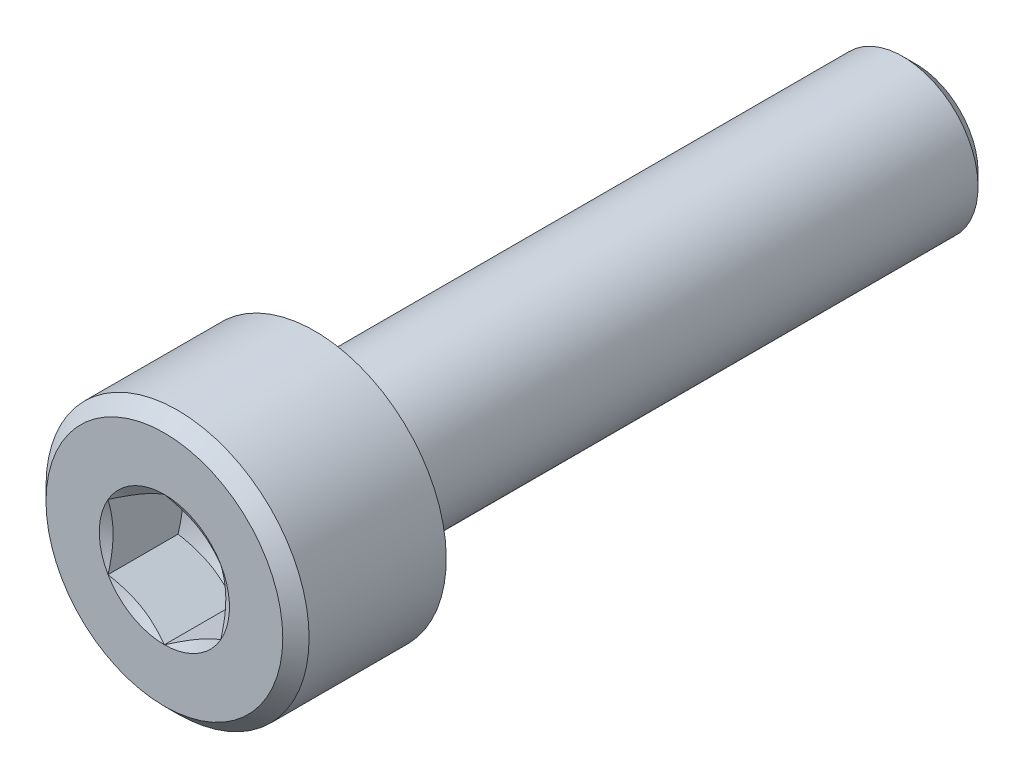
ISO-10303-21;
HEADER;
FILE_DESCRIPTION(('STEP AP214'),'2;1');
FILE_NAME('part.step','',(''),(''),'','','');
FILE_SCHEMA(('AUTOMOTIVE_DESIGN { 1 0 10303 214 1 1 1 1 }'));
ENDSEC;
DATA;
#1=APPLICATION_CONTEXT('core data for automotive mechanical design processes');
#2=APPLICATION_PROTOCOL_DEFINITION('international standard','automotive_design',2000,#1);
#3=PRODUCT_CONTEXT('',#1,'mechanical');
#4=PRODUCT('Part','Part','',(#3));
#5=PRODUCT_RELATED_PRODUCT_CATEGORY('part','',(#4));
#6=PRODUCT_DEFINITION_FORMATION('','',#4);
#7=PRODUCT_DEFINITION_CONTEXT('part definition',#1,'design');
#8=PRODUCT_DEFINITION('design','',#6,#7);
#9=PRODUCT_DEFINITION_SHAPE('','',#8);
#10=(LENGTH_UNIT() NAMED_UNIT(*) SI_UNIT(.MILLI.,.METRE.));
#11=(NAMED_UNIT(*) PLANE_ANGLE_UNIT() SI_UNIT($,.RADIAN.));
#12=(NAMED_UNIT(*) SI_UNIT($,.STERADIAN.) SOLID_ANGLE_UNIT());
#13=UNCERTAINTY_MEASURE_WITH_UNIT(LENGTH_MEASURE(1.E-05),#10,'distance_accuracy_value','');
#14=(GEOMETRIC_REPRESENTATION_CONTEXT(3) GLOBAL_UNCERTAINTY_ASSIGNED_CONTEXT((#13)) GLOBAL_UNIT_ASSIGNED_CONTEXT((#10,
#11,#12)) REPRESENTATION_CONTEXT('',''));
#15=CARTESIAN_POINT('',(0.,0.,0.));
#16=DIRECTION('',(0.,0.,1.));
#17=DIRECTION('',(1.,0.,0.));
#18=AXIS2_PLACEMENT_3D('',#15,#16,#17);
#19=CARTESIAN_POINT('',(0.,3.5,4.));
#20=DIRECTION('',(0.,0.,-1.));
#21=DIRECTION('',(0.,1.,0.));
#22=AXIS2_PLACEMENT_3D('',#19,#20,#21);
#23=PLANE('',#22);
#24=CARTESIAN_POINT('',(0.,0.,4.));
#25=DIRECTION('',(0.,0.,-1.));
#26=DIRECTION('',(0.,1.,0.));
#27=AXIS2_PLACEMENT_3D('',#24,#25,#26);
#28=CIRCLE('',#27,3.15);
#29=CARTESIAN_POINT('',(0.,3.15,4.));
#30=VERTEX_POINT('',#29);
#31=EDGE_CURVE('E297',#30,#30,#28,.F.);
#32=ORIENTED_EDGE('',*,*,#31,.T.);
#33=EDGE_LOOP('',(#32));
#34=FACE_BOUND('',#33,.T.);
#35=CARTESIAN_POINT('',(0.,0.,4.));
#36=DIRECTION('',(0.,0.,-1.));
#37=DIRECTION('',(0.,1.,0.));
#38=AXIS2_PLACEMENT_3D('',#35,#36,#37);
#39=CIRCLE('',#38,1.73205080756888);
#40=CARTESIAN_POINT('',(0.,1.73205080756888,4.));
#41=VERTEX_POINT('',#40);
#42=CARTESIAN_POINT('',(-1.5,0.866025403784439,4.));
#43=VERTEX_POINT('',#42);
#44=EDGE_CURVE('E106',#41,#43,#39,.F.);
#45=ORIENTED_EDGE('',*,*,#44,.F.);
#46=CARTESIAN_POINT('',(1.5,0.866025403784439,4.));
#47=VERTEX_POINT('',#46);
#48=EDGE_CURVE('E94',#47,#41,#39,.F.);
#49=ORIENTED_EDGE('',*,*,#48,.F.);
#50=CARTESIAN_POINT('',(1.5,-0.866025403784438,4.));
#51=VERTEX_POINT('',#50);
#52=EDGE_CURVE('E104',#51,#47,#39,.F.);
#53=ORIENTED_EDGE('',*,*,#52,.F.);
#54=CARTESIAN_POINT('',(0.,-1.73205080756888,4.));
#55=VERTEX_POINT('',#54);
#56=EDGE_CURVE('E497',#55,#51,#39,.F.);
#57=ORIENTED_EDGE('',*,*,#56,.F.);
#58=CARTESIAN_POINT('',(-1.5,-0.866025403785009,3.99999999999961));
#59=VERTEX_POINT('',#58);
#60=EDGE_CURVE('E140',#59,#55,#39,.F.);
#61=ORIENTED_EDGE('',*,*,#60,.F.);
#62=EDGE_CURVE('E136',#43,#59,#39,.F.);
#63=ORIENTED_EDGE('',*,*,#62,.F.);
#64=EDGE_LOOP('',(#45,#49,#53,#57,#61,#63));
#65=FACE_BOUND('',#64,.T.);
#66=ADVANCED_FACE('F37',(#34,#65),#23,.F.);
#67=CARTESIAN_POINT('',(0.,2.,0.));
#68=DIRECTION('',(0.,0.,1.));
#69=DIRECTION('',(0.,-1.,0.));
#70=AXIS2_PLACEMENT_3D('',#67,#68,#69);
#71=PLANE('',#70);
#72=CARTESIAN_POINT('',(0.,0.,0.));
#73=DIRECTION('',(0.,0.,1.));
#74=DIRECTION('',(0.,-1.,0.));
#75=AXIS2_PLACEMENT_3D('',#72,#73,#74);
#76=CIRCLE('',#75,2.4);
#77=CARTESIAN_POINT('',(0.,-2.4,0.));
#78=VERTEX_POINT('',#77);
#79=EDGE_CURVE('E46',#78,#78,#76,.T.);
#80=ORIENTED_EDGE('',*,*,#79,.T.);
#81=EDGE_LOOP('',(#80));
#82=FACE_BOUND('',#81,.T.);
#83=CARTESIAN_POINT('',(0.,0.,0.));
#84=DIRECTION('',(0.,0.,1.));
#85=DIRECTION('',(0.,-1.,0.));
#86=AXIS2_PLACEMENT_3D('',#83,#84,#85);
#87=CIRCLE('',#86,3.5);
#88=CARTESIAN_POINT('',(0.,-3.5,0.));
#89=VERTEX_POINT('',#88);
#90=EDGE_CURVE('E464',#89,#89,#87,.T.);
#91=ORIENTED_EDGE('',*,*,#90,.F.);
#92=EDGE_LOOP('',(#91));
#93=FACE_BOUND('',#92,.T.);
#94=ADVANCED_FACE('F255',(#82,#93),#71,.F.);
#95=CARTESIAN_POINT('',(0.,0.,4.));
#96=DIRECTION('',(0.,0.,1.));
#97=DIRECTION('',(0.,-1.,0.));
#98=AXIS2_PLACEMENT_3D('',#95,#96,#97);
#99=CYLINDRICAL_SURFACE('',#98,2.);
#100=CARTESIAN_POINT('',(0.,0.,-0.4));
#101=DIRECTION('',(0.,0.,1.));
#102=DIRECTION('',(0.,-1.,0.));
#103=AXIS2_PLACEMENT_3D('',#100,#101,#102);
#104=CIRCLE('',#103,2.);
#105=CARTESIAN_POINT('',(0.,-2.,-0.4));
#106=VERTEX_POINT('',#105);
#107=EDGE_CURVE('E12',#106,#106,#104,.F.);
#108=ORIENTED_EDGE('',*,*,#107,.T.);
#109=EDGE_LOOP('',(#108));
#110=FACE_BOUND('',#109,.T.);
#111=CARTESIAN_POINT('',(0.,0.,-15.65));
#112=DIRECTION('',(0.,0.,1.));
#113=DIRECTION('',(0.,-1.,0.));
#114=AXIS2_PLACEMENT_3D('',#111,#112,#113);
#115=CIRCLE('',#114,2.);
#116=CARTESIAN_POINT('',(0.,-2.,-15.65));
#117=VERTEX_POINT('',#116);
#118=EDGE_CURVE('E287',#117,#117,#115,.T.);
#119=ORIENTED_EDGE('',*,*,#118,.T.);
#120=EDGE_LOOP('',(#119));
#121=FACE_BOUND('',#120,.T.);
#122=ADVANCED_FACE('F260',(#110,#121),#99,.T.);
#123=CARTESIAN_POINT('',(0.,0.,-16.));
#124=DIRECTION('',(0.,0.,1.));
#125=DIRECTION('',(0.,-1.,0.));
#126=AXIS2_PLACEMENT_3D('',#123,#124,#125);
#127=PLANE('',#126);
#128=CARTESIAN_POINT('',(0.,0.,-16.));
#129=DIRECTION('',(0.,0.,1.));
#130=DIRECTION('',(0.,-1.,0.));
#131=AXIS2_PLACEMENT_3D('',#128,#129,#130);
#132=CIRCLE('',#131,1.64999999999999);
#133=CARTESIAN_POINT('',(0.,-1.64999999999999,-16.));
#134=VERTEX_POINT('',#133);
#135=EDGE_CURVE('E117',#134,#134,#132,.F.);
#136=ORIENTED_EDGE('',*,*,#135,.T.);
#137=EDGE_LOOP('',(#136));
#138=FACE_BOUND('',#137,.T.);
#139=ADVANCED_FACE('F265',(#138),#127,.F.);
#140=CARTESIAN_POINT('',(0.,0.,4.));
#141=DIRECTION('',(0.,0.,1.));
#142=DIRECTION('',(0.,-1.,0.));
#143=AXIS2_PLACEMENT_3D('',#140,#141,#142);
#144=CYLINDRICAL_SURFACE('',#143,3.5);
#145=CARTESIAN_POINT('',(0.,0.,3.65));
#146=DIRECTION('',(0.,0.,-1.));
#147=DIRECTION('',(0.,1.,0.));
#148=AXIS2_PLACEMENT_3D('',#145,#146,#147);
#149=CIRCLE('',#148,3.5);
#150=CARTESIAN_POINT('',(0.,3.5,3.65));
#151=VERTEX_POINT('',#150);
#152=EDGE_CURVE('E290',#151,#151,#149,.T.);
#153=ORIENTED_EDGE('',*,*,#152,.T.);
#154=EDGE_LOOP('',(#153));
#155=FACE_BOUND('',#154,.T.);
#156=ORIENTED_EDGE('',*,*,#90,.T.);
#157=EDGE_LOOP('',(#156));
#158=FACE_BOUND('',#157,.T.);
#159=ADVANCED_FACE('F175',(#155,#158),#144,.T.);
#160=CARTESIAN_POINT('',(0.,0.,4.));
#161=DIRECTION('',(0.,0.,-1.));
#162=DIRECTION('',(0.,1.,0.));
#163=AXIS2_PLACEMENT_3D('',#160,#161,#162);
#164=CONICAL_SURFACE('',#163,3.15,0.785398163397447);
#165=ORIENTED_EDGE('',*,*,#152,.F.);
#166=EDGE_LOOP('',(#165));
#167=FACE_BOUND('',#166,.T.);
#168=ORIENTED_EDGE('',*,*,#31,.F.);
#169=EDGE_LOOP('',(#168));
#170=FACE_BOUND('',#169,.T.);
#171=ADVANCED_FACE('F272',(#167,#170),#164,.T.);
#172=CARTESIAN_POINT('',(0.,0.,-15.65));
#173=DIRECTION('',(0.,0.,1.));
#174=DIRECTION('',(0.,-1.,0.));
#175=AXIS2_PLACEMENT_3D('',#172,#173,#174);
#176=CONICAL_SURFACE('',#175,2.,0.78539816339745);
#177=ORIENTED_EDGE('',*,*,#135,.F.);
#178=EDGE_LOOP('',(#177));
#179=FACE_BOUND('',#178,.T.);
#180=ORIENTED_EDGE('',*,*,#118,.F.);
#181=EDGE_LOOP('',(#180));
#182=FACE_BOUND('',#181,.T.);
#183=ADVANCED_FACE('F274',(#179,#182),#176,.T.);
#184=CARTESIAN_POINT('',(0.,0.,3.86602540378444));
#185=DIRECTION('',(0.,0.,1.));
#186=DIRECTION('',(0.,-1.,0.));
#187=AXIS2_PLACEMENT_3D('',#184,#185,#186);
#188=CONICAL_SURFACE('',#187,1.5,1.04719755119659);
#189=ORIENTED_EDGE('',*,*,#44,.T.);
#190=CARTESIAN_POINT('',(-1.5002,0.865909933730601,4.00006667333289));
#191=CARTESIAN_POINT('',(-1.43428070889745,0.903968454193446,3.97808285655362));
#192=CARTESIAN_POINT('',(-1.36779241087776,0.942355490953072,3.95808888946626));
#193=CARTESIAN_POINT('',(-1.23366433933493,1.01979436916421,3.92318810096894));
#194=CARTESIAN_POINT('',(-1.16602218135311,1.05884758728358,3.9082936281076));
#195=CARTESIAN_POINT('',(-1.03157622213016,1.13646999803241,3.88510668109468));
#196=CARTESIAN_POINT('',(-0.96479311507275,1.17502724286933,3.87665991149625));
#197=CARTESIAN_POINT('',(-0.830912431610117,1.25232329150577,3.86657357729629));
#198=CARTESIAN_POINT('',(-0.763815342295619,1.29106181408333,3.86492566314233));
#199=CARTESIAN_POINT('',(-0.638425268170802,1.363455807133,3.86834162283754));
#200=CARTESIAN_POINT('',(-0.580113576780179,1.39712207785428,3.87256675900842));
#201=CARTESIAN_POINT('',(-0.463870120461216,1.46423526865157,3.88596177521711));
#202=CARTESIAN_POINT('',(-0.405938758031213,1.49768195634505,3.89513623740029));
#203=CARTESIAN_POINT('',(-0.289455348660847,1.56493368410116,3.91807318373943));
#204=CARTESIAN_POINT('',(-0.230918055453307,1.59873020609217,3.93193296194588));
#205=CARTESIAN_POINT('',(-0.11471687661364,1.6658189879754,3.96338978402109));
#206=CARTESIAN_POINT('',(-0.0570515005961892,1.699112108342,3.98097942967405));
#207=CARTESIAN_POINT('',(0.000199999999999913,1.73216627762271,4.00006667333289));
#208=B_SPLINE_CURVE_WITH_KNOTS('',3,(#190,#191,#192,#193,#194,#195,#196,#197,#198,#199,#200,
#201,#202,#203,#204,#205,#206,#207),.UNSPECIFIED.,.F.,.F.,(4,2,2,2,2,2,2,2,4),(0.,
0.237777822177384,0.47612742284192,0.708577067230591,0.940741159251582,1.14294352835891,
1.34533342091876,1.55221450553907,1.75868901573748),.UNSPECIFIED.);
#209=EDGE_CURVE('E110',#43,#41,#208,.T.);
#210=ORIENTED_EDGE('',*,*,#209,.T.);
#211=EDGE_LOOP('',(#189,#210));
#212=FACE_BOUND('',#211,.T.);
#213=ADVANCED_FACE('F111',(#212),#188,.F.);
#214=ORIENTED_EDGE('',*,*,#62,.T.);
#215=CARTESIAN_POINT('',(-1.5,-2.29682699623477,4.58381546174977));
#216=CARTESIAN_POINT('',(-1.5,-2.2309684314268,4.55198894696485));
#217=CARTESIAN_POINT('',(-1.5,-2.16495427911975,4.52047890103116));
#218=CARTESIAN_POINT('',(-1.5,-2.03253035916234,4.45827236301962));
#219=CARTESIAN_POINT('',(-1.5,-1.96612052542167,4.42757601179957));
#220=CARTESIAN_POINT('',(-1.5,-1.83246206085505,4.36701576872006));
#221=CARTESIAN_POINT('',(-1.5,-1.76521080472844,4.33715764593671));
#222=CARTESIAN_POINT('',(-1.5,-1.63015654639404,4.27872457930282));
#223=CARTESIAN_POINT('',(-1.5,-1.56235357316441,4.25014956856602));
#224=CARTESIAN_POINT('',(-1.5,-1.42524182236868,4.19428123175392));
#225=CARTESIAN_POINT('',(-1.5,-1.35592477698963,4.1670079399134));
#226=CARTESIAN_POINT('',(-1.5,-1.21648682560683,4.114607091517));
#227=CARTESIAN_POINT('',(-1.5,-1.14636582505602,4.08947979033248));
#228=CARTESIAN_POINT('',(-1.5,-0.934888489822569,4.01830655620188));
#229=CARTESIAN_POINT('',(-1.5,-0.792055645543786,3.97631519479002));
#230=CARTESIAN_POINT('',(-1.5,-0.574716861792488,3.92662686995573));
#231=CARTESIAN_POINT('',(-1.5,-0.501740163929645,3.91227894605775));
#232=CARTESIAN_POINT('',(-1.5,-0.35490257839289,3.88900178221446));
#233=CARTESIAN_POINT('',(-1.5,-0.281041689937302,3.88007254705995));
#234=CARTESIAN_POINT('',(-1.5,-0.133293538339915,3.86841949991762));
#235=CARTESIAN_POINT('',(-1.5,-0.0594094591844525,3.86565640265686));
#236=CARTESIAN_POINT('',(-1.5,0.0882997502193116,3.86647471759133));
#237=CARTESIAN_POINT('',(-1.5,0.16212489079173,3.87005448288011));
#238=CARTESIAN_POINT('',(-1.5,0.340722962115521,3.88606868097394));
#239=CARTESIAN_POINT('',(-1.5,0.445215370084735,3.9016376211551));
#240=CARTESIAN_POINT('',(-1.5,0.652266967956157,3.94267501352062));
#241=CARTESIAN_POINT('',(-1.5,0.75482373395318,3.96815511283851));
#242=CARTESIAN_POINT('',(-1.5,0.908315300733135,4.0120946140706));
#243=CARTESIAN_POINT('',(-1.5,0.960034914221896,4.02791828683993));
#244=CARTESIAN_POINT('',(-1.5,1.06293144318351,4.0611319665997));
#245=CARTESIAN_POINT('',(-1.5,1.11410870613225,4.07852089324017));
#246=CARTESIAN_POINT('',(-1.5,1.21571016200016,4.11450258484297));
#247=CARTESIAN_POINT('',(-1.5,1.26613697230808,4.13308802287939));
#248=CARTESIAN_POINT('',(-1.5,1.36659934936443,4.17134976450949));
#249=CARTESIAN_POINT('',(-1.5,1.41663474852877,4.19102650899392));
#250=CARTESIAN_POINT('',(-1.5,1.46648887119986,4.21114128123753));
#251=B_SPLINE_CURVE_WITH_KNOTS('',3,(#215,#216,#217,#218,#219,#220,#221,#222,#223,#224,#225,
#226,#227,#228,#229,#230,#231,#232,#233,#234,#235,#236,#237,#238,#239,#240,#241,#242,#243,#244,
#245,#246,#247,#248,#249,#250),.UNSPECIFIED.,.F.,.F.,(4,2,2,2,2,2,2,2,2,2,2,2,2,2,2,2,2,4),(0.,
0.219439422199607,0.438916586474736,0.659649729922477,0.880371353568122,1.10380188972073,
1.32725897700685,1.77299403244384,1.99595442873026,2.21891502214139,2.44045099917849,
2.66192946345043,2.97821851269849,3.29488037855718,3.45711959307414,3.6192476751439,
3.78046319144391,3.94174432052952),.UNSPECIFIED.);
#252=EDGE_CURVE('E237',#59,#43,#251,.T.);
#253=ORIENTED_EDGE('',*,*,#252,.T.);
#254=EDGE_LOOP('',(#214,#253));
#255=FACE_BOUND('',#254,.T.);
#256=ADVANCED_FACE('F281',(#255),#188,.F.);
#257=ORIENTED_EDGE('',*,*,#60,.T.);
#258=CARTESIAN_POINT('',(0.000200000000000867,-1.73216627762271,4.00006667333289));
#259=CARTESIAN_POINT('',(-0.0657192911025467,-1.69410775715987,3.97808285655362));
#260=CARTESIAN_POINT('',(-0.132207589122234,-1.65572072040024,3.95808888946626));
#261=CARTESIAN_POINT('',(-0.266335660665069,-1.5782818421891,3.92318810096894));
#262=CARTESIAN_POINT('',(-0.333977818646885,-1.53922862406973,3.9082936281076));
#263=CARTESIAN_POINT('',(-0.468423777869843,-1.4616062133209,3.88510668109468));
#264=CARTESIAN_POINT('',(-0.535206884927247,-1.42304896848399,3.87665991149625));
#265=CARTESIAN_POINT('',(-0.66908756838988,-1.34575291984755,3.86657357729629));
#266=CARTESIAN_POINT('',(-0.736184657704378,-1.30701439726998,3.86492566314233));
#267=CARTESIAN_POINT('',(-0.861574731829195,-1.23462040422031,3.86834162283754));
#268=CARTESIAN_POINT('',(-0.919886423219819,-1.20095413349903,3.87256675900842));
#269=CARTESIAN_POINT('',(-1.03612987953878,-1.13384094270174,3.88596177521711));
#270=CARTESIAN_POINT('',(-1.09406124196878,-1.10039425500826,3.89513623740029));
#271=CARTESIAN_POINT('',(-1.21054465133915,-1.03314252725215,3.91807318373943));
#272=CARTESIAN_POINT('',(-1.26908194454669,-0.99934600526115,3.93193296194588));
#273=CARTESIAN_POINT('',(-1.38528312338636,-0.932257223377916,3.96338978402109));
#274=CARTESIAN_POINT('',(-1.44294849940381,-0.89896410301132,3.98097942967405));
#275=CARTESIAN_POINT('',(-1.5002,-0.8659099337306,4.00006667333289));
#276=B_SPLINE_CURVE_WITH_KNOTS('',3,(#258,#259,#260,#261,#262,#263,#264,#265,#266,#267,#268,
#269,#270,#271,#272,#273,#274,#275),.UNSPECIFIED.,.F.,.F.,(4,2,2,2,2,2,2,2,4),(0.,
0.237777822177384,0.47612742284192,0.708577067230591,0.940741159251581,1.14294352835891,
1.34533342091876,1.55221450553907,1.75868901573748),.UNSPECIFIED.);
#277=EDGE_CURVE('E230',#55,#59,#276,.T.);
#278=ORIENTED_EDGE('',*,*,#277,.T.);
#279=EDGE_LOOP('',(#257,#278));
#280=FACE_BOUND('',#279,.T.);
#281=ADVANCED_FACE('F383',(#280),#188,.F.);
#282=ORIENTED_EDGE('',*,*,#56,.T.);
#283=CARTESIAN_POINT('',(1.5002,-0.8659099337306,4.00006667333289));
#284=CARTESIAN_POINT('',(1.43428070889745,-0.903968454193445,3.97808285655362));
#285=CARTESIAN_POINT('',(1.36779241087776,-0.942355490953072,3.95808888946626));
#286=CARTESIAN_POINT('',(1.23366433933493,-1.01979436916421,3.92318810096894));
#287=CARTESIAN_POINT('',(1.16602218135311,-1.05884758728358,3.9082936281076));
#288=CARTESIAN_POINT('',(1.03157622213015,-1.13646999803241,3.88510668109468));
#289=CARTESIAN_POINT('',(0.96479311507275,-1.17502724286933,3.87665991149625));
#290=CARTESIAN_POINT('',(0.830912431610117,-1.25232329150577,3.86657357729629));
#291=CARTESIAN_POINT('',(0.763815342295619,-1.29106181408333,3.86492566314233));
#292=CARTESIAN_POINT('',(0.638425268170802,-1.363455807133,3.86834162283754));
#293=CARTESIAN_POINT('',(0.580113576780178,-1.39712207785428,3.87256675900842));
#294=CARTESIAN_POINT('',(0.463870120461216,-1.46423526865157,3.88596177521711));
#295=CARTESIAN_POINT('',(0.405938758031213,-1.49768195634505,3.89513623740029));
#296=CARTESIAN_POINT('',(0.289455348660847,-1.56493368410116,3.91807318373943));
#297=CARTESIAN_POINT('',(0.230918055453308,-1.59873020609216,3.93193296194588));
#298=CARTESIAN_POINT('',(0.11471687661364,-1.6658189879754,3.96338978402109));
#299=CARTESIAN_POINT('',(0.0570515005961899,-1.69911210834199,3.98097942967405));
#300=CARTESIAN_POINT('',(-0.000199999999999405,-1.73216627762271,4.00006667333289));
#301=B_SPLINE_CURVE_WITH_KNOTS('',3,(#283,#284,#285,#286,#287,#288,#289,#290,#291,#292,#293,
#294,#295,#296,#297,#298,#299,#300),.UNSPECIFIED.,.F.,.F.,(4,2,2,2,2,2,2,2,4),(0.,
0.237777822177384,0.476127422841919,0.70857706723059,0.940741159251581,1.1429435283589,
1.34533342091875,1.55221450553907,1.75868901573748),.UNSPECIFIED.);
#302=EDGE_CURVE('E58',#51,#55,#301,.T.);
#303=ORIENTED_EDGE('',*,*,#302,.T.);
#304=EDGE_LOOP('',(#282,#303));
#305=FACE_BOUND('',#304,.T.);
#306=ADVANCED_FACE('F392',(#305),#188,.F.);
#307=ORIENTED_EDGE('',*,*,#52,.T.);
#308=CARTESIAN_POINT('',(1.5,-2.29682699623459,4.58381546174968));
#309=CARTESIAN_POINT('',(1.5,-2.23096843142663,4.55198894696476));
#310=CARTESIAN_POINT('',(1.5,-2.16495427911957,4.52047890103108));
#311=CARTESIAN_POINT('',(1.5,-2.03253035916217,4.45827236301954));
#312=CARTESIAN_POINT('',(1.5,-1.9661205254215,4.42757601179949));
#313=CARTESIAN_POINT('',(1.5,-1.83246206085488,4.36701576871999));
#314=CARTESIAN_POINT('',(1.5,-1.76521080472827,4.33715764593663));
#315=CARTESIAN_POINT('',(1.5,-1.63015654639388,4.27872457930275));
#316=CARTESIAN_POINT('',(1.5,-1.56235357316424,4.25014956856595));
#317=CARTESIAN_POINT('',(1.5,-1.42524182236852,4.19428123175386));
#318=CARTESIAN_POINT('',(1.5,-1.35592477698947,4.16700793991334));
#319=CARTESIAN_POINT('',(1.5,-1.21648682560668,4.11460709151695));
#320=CARTESIAN_POINT('',(1.5,-1.14636582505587,4.08947979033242));
#321=CARTESIAN_POINT('',(1.5,-0.934888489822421,4.01830655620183));
#322=CARTESIAN_POINT('',(1.5,-0.792055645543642,3.97631519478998));
#323=CARTESIAN_POINT('',(1.5,-0.57471686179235,3.9266268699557));
#324=CARTESIAN_POINT('',(1.5,-0.501740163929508,3.91227894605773));
#325=CARTESIAN_POINT('',(1.5,-0.354902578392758,3.88900178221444));
#326=CARTESIAN_POINT('',(1.5,-0.281041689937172,3.88007254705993));
#327=CARTESIAN_POINT('',(1.5,-0.133293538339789,3.86841949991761));
#328=CARTESIAN_POINT('',(1.5,-0.0594094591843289,3.86565640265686));
#329=CARTESIAN_POINT('',(1.5,0.0882997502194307,3.86647471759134));
#330=CARTESIAN_POINT('',(1.5,0.162124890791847,3.87005448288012));
#331=CARTESIAN_POINT('',(1.5,0.340722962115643,3.88606868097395));
#332=CARTESIAN_POINT('',(1.5,0.445215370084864,3.90163762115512));
#333=CARTESIAN_POINT('',(1.5,0.6522669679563,3.94267501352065));
#334=CARTESIAN_POINT('',(1.5,0.75482373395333,3.96815511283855));
#335=CARTESIAN_POINT('',(1.5,0.908315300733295,4.01209461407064));
#336=CARTESIAN_POINT('',(1.5,0.96003491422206,4.02791828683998));
#337=CARTESIAN_POINT('',(1.5,1.06293144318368,4.06113196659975));
#338=CARTESIAN_POINT('',(1.5,1.11410870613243,4.07852089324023));
#339=CARTESIAN_POINT('',(1.5,1.21571016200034,4.11450258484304));
#340=CARTESIAN_POINT('',(1.5,1.26613697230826,4.13308802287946));
#341=CARTESIAN_POINT('',(1.5,1.36659934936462,4.17134976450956));
#342=CARTESIAN_POINT('',(1.5,1.41663474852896,4.19102650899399));
#343=CARTESIAN_POINT('',(1.5,1.46648887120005,4.21114128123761));
#344=B_SPLINE_CURVE_WITH_KNOTS('',3,(#308,#309,#310,#311,#312,#313,#314,#315,#316,#317,#318,
#319,#320,#321,#322,#323,#324,#325,#326,#327,#328,#329,#330,#331,#332,#333,#334,#335,#336,#337,
#338,#339,#340,#341,#342,#343),.UNSPECIFIED.,.F.,.F.,(4,2,2,2,2,2,2,2,2,2,2,2,2,2,2,2,2,4),(0.,
0.219439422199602,0.438916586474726,0.659649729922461,0.8803713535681,1.1038018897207,
1.32725897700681,1.77299403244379,1.99595442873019,2.21891502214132,2.44045099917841,
2.66192946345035,2.97821851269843,3.29488037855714,3.45711959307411,3.61924767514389,
3.78046319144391,3.94174432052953),.UNSPECIFIED.);
#345=EDGE_CURVE('E52',#47,#51,#344,.F.);
#346=ORIENTED_EDGE('',*,*,#345,.T.);
#347=EDGE_LOOP('',(#307,#346));
#348=FACE_BOUND('',#347,.T.);
#349=ADVANCED_FACE('F401',(#348),#188,.F.);
#350=ORIENTED_EDGE('',*,*,#48,.T.);
#351=CARTESIAN_POINT('',(-0.000200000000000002,1.73216627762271,4.00006667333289));
#352=CARTESIAN_POINT('',(0.0657192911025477,1.69410775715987,3.97808285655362));
#353=CARTESIAN_POINT('',(0.132207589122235,1.65572072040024,3.95808888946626));
#354=CARTESIAN_POINT('',(0.266335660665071,1.5782818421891,3.92318810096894));
#355=CARTESIAN_POINT('',(0.333977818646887,1.53922862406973,3.9082936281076));
#356=CARTESIAN_POINT('',(0.468423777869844,1.4616062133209,3.88510668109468));
#357=CARTESIAN_POINT('',(0.535206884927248,1.42304896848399,3.87665991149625));
#358=CARTESIAN_POINT('',(0.669087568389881,1.34575291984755,3.86657357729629));
#359=CARTESIAN_POINT('',(0.736184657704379,1.30701439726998,3.86492566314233));
#360=CARTESIAN_POINT('',(0.861574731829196,1.23462040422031,3.86834162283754));
#361=CARTESIAN_POINT('',(0.91988642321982,1.20095413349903,3.87256675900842));
#362=CARTESIAN_POINT('',(1.03612987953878,1.13384094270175,3.88596177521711));
#363=CARTESIAN_POINT('',(1.09406124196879,1.10039425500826,3.89513623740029));
#364=CARTESIAN_POINT('',(1.21054465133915,1.03314252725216,3.91807318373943));
#365=CARTESIAN_POINT('',(1.26908194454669,0.999346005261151,3.93193296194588));
#366=CARTESIAN_POINT('',(1.38528312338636,0.932257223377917,3.96338978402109));
#367=CARTESIAN_POINT('',(1.44294849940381,0.898964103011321,3.98097942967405));
#368=CARTESIAN_POINT('',(1.5002,0.865909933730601,4.00006667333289));
#369=B_SPLINE_CURVE_WITH_KNOTS('',3,(#351,#352,#353,#354,#355,#356,#357,#358,#359,#360,#361,
#362,#363,#364,#365,#366,#367,#368),.UNSPECIFIED.,.F.,.F.,(4,2,2,2,2,2,2,2,4),(0.,
0.237777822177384,0.47612742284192,0.708577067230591,0.940741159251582,1.14294352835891,
1.34533342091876,1.55221450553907,1.75868901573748),.UNSPECIFIED.);
#370=EDGE_CURVE('E98',#41,#47,#369,.T.);
#371=ORIENTED_EDGE('',*,*,#370,.T.);
#372=EDGE_LOOP('',(#350,#371));
#373=FACE_BOUND('',#372,.T.);
#374=ADVANCED_FACE('F96',(#373),#188,.F.);
#375=CARTESIAN_POINT('',(0.,0.,1.13397459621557));
#376=DIRECTION('',(0.,0.,1.));
#377=DIRECTION('',(1.,0.,0.));
#378=AXIS2_PLACEMENT_3D('',#375,#376,#377);
#379=CONICAL_SURFACE('',#378,0.,1.0471975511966);
#380=CARTESIAN_POINT('',(1.5002,-0.8659099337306,2.13404126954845));
#381=CARTESIAN_POINT('',(1.43428070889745,-0.903968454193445,2.11205745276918));
#382=CARTESIAN_POINT('',(1.36779241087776,-0.942355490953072,2.09206348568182));
#383=CARTESIAN_POINT('',(1.23366433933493,-1.01979436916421,2.05716269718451));
#384=CARTESIAN_POINT('',(1.16602218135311,-1.05884758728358,2.04226822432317));
#385=CARTESIAN_POINT('',(1.03157622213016,-1.13646999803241,2.01908127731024));
#386=CARTESIAN_POINT('',(0.964793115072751,-1.17502724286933,2.01063450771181));
#387=CARTESIAN_POINT('',(0.830912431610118,-1.25232329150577,2.00054817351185));
#388=CARTESIAN_POINT('',(0.76381534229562,-1.29106181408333,1.99890025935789));
#389=CARTESIAN_POINT('',(0.638425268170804,-1.363455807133,2.0023162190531));
#390=CARTESIAN_POINT('',(0.58011357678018,-1.39712207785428,2.00654135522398));
#391=CARTESIAN_POINT('',(0.463870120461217,-1.46423526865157,2.01993637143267));
#392=CARTESIAN_POINT('',(0.405938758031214,-1.49768195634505,2.02911083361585));
#393=CARTESIAN_POINT('',(0.289455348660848,-1.56493368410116,2.05204777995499));
#394=CARTESIAN_POINT('',(0.230918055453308,-1.59873020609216,2.06590755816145));
#395=CARTESIAN_POINT('',(0.114716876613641,-1.6658189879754,2.09736438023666));
#396=CARTESIAN_POINT('',(0.0570515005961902,-1.69911210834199,2.11495402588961));
#397=CARTESIAN_POINT('',(-0.000199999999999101,-1.73216627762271,2.13404126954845));
#398=B_SPLINE_CURVE_WITH_KNOTS('',3,(#380,#381,#382,#383,#384,#385,#386,#387,#388,#389,#390,
#391,#392,#393,#394,#395,#396,#397),.UNSPECIFIED.,.F.,.F.,(4,2,2,2,2,2,2,2,4),(0.,
0.237777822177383,0.476127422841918,0.708577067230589,0.940741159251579,1.1429435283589,
1.34533342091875,1.55221450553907,1.75868901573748),.UNSPECIFIED.);
#399=CARTESIAN_POINT('',(1.5,-0.866025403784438,2.13397459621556));
#400=VERTEX_POINT('',#399);
#401=CARTESIAN_POINT('',(0.,-1.73205080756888,2.13397459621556));
#402=VERTEX_POINT('',#401);
#403=EDGE_CURVE('E189',#400,#402,#398,.T.);
#404=ORIENTED_EDGE('',*,*,#403,.F.);
#405=CARTESIAN_POINT('',(1.5,-2.33638172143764,2.73695926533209));
#406=CARTESIAN_POINT('',(1.5,-2.27073746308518,2.7050753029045));
#407=CARTESIAN_POINT('',(1.5,-2.20494350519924,2.67349431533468));
#408=CARTESIAN_POINT('',(1.5,-2.07297652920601,2.61110864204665));
#409=CARTESIAN_POINT('',(1.5,-2.00680345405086,2.5803040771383));
#410=CARTESIAN_POINT('',(1.5,-1.87366303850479,2.51948904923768));
#411=CARTESIAN_POINT('',(1.5,-1.80669334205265,2.48948372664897));
#412=CARTESIAN_POINT('',(1.5,-1.67222431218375,2.43068893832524));
#413=CARTESIAN_POINT('',(1.5,-1.60472500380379,2.40189941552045));
#414=CARTESIAN_POINT('',(1.5,-1.46696329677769,2.34497876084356));
#415=CARTESIAN_POINT('',(1.5,-1.39668058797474,2.31689651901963));
#416=CARTESIAN_POINT('',(1.5,-1.25529643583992,2.26283280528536));
#417=CARTESIAN_POINT('',(1.5,-1.1841948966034,2.23685158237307));
#418=CARTESIAN_POINT('',(1.5,-1.04119289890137,2.18766516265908));
#419=CARTESIAN_POINT('',(1.5,-0.969294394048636,2.16445434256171));
#420=CARTESIAN_POINT('',(1.5,-0.824460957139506,2.12154326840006));
#421=CARTESIAN_POINT('',(1.5,-0.751526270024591,2.10184219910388));
#422=CARTESIAN_POINT('',(1.5,-0.604949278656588,2.06698624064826));
#423=CARTESIAN_POINT('',(1.5,-0.531312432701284,2.05180882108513));
#424=CARTESIAN_POINT('',(1.5,-0.383114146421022,2.0268654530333));
#425=CARTESIAN_POINT('',(1.5,-0.308552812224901,2.0170988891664));
#426=CARTESIAN_POINT('',(1.5,-0.159849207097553,2.00388569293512));
#427=CARTESIAN_POINT('',(1.5,-0.0857144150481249,2.00035726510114));
#428=CARTESIAN_POINT('',(1.5,0.0625848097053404,1.9996942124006));
#429=CARTESIAN_POINT('',(1.5,0.136749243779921,2.00255992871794));
#430=CARTESIAN_POINT('',(1.5,0.313926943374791,2.0167964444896));
#431=CARTESIAN_POINT('',(1.5,0.416706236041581,2.03109167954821));
#432=CARTESIAN_POINT('',(1.5,0.6204409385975,2.06949441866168));
#433=CARTESIAN_POINT('',(1.5,0.721394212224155,2.09361272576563));
#434=CARTESIAN_POINT('',(1.5,0.872531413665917,2.13552332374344));
#435=CARTESIAN_POINT('',(1.5,0.923479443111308,2.15066992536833));
#436=CARTESIAN_POINT('',(1.5,1.0248466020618,2.18254554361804));
#437=CARTESIAN_POINT('',(1.5,1.07526602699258,2.1992736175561));
#438=CARTESIAN_POINT('',(1.5,1.17563999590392,2.234052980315));
#439=CARTESIAN_POINT('',(1.5,1.22559456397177,2.25210420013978));
#440=CARTESIAN_POINT('',(1.5,1.32509493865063,2.28931641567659));
#441=CARTESIAN_POINT('',(1.5,1.37464068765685,2.30847756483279));
#442=CARTESIAN_POINT('',(1.5,1.54079899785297,2.37451828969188));
#443=CARTESIAN_POINT('',(1.5,1.65657296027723,2.42350677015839));
#444=CARTESIAN_POINT('',(1.5,1.88662968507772,2.52488299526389));
#445=CARTESIAN_POINT('',(1.5,2.00091210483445,2.57727150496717));
#446=CARTESIAN_POINT('',(1.5,2.22843594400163,2.68441475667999));
#447=CARTESIAN_POINT('',(1.5,2.34167674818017,2.73917080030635));
#448=CARTESIAN_POINT('',(1.5,2.56734049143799,2.85034680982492));
#449=CARTESIAN_POINT('',(1.5,2.6797633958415,2.9067668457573));
#450=CARTESIAN_POINT('',(1.5,3.01663743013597,3.07808122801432));
#451=CARTESIAN_POINT('',(1.5,3.24017029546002,3.19477748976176));
#452=CARTESIAN_POINT('',(1.5,3.68570645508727,3.43083807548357));
#453=CARTESIAN_POINT('',(1.5,3.9077102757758,3.55020141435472));
#454=CARTESIAN_POINT('',(1.5,4.31835016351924,3.77304008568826));
#455=CARTESIAN_POINT('',(1.5,4.50711258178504,3.87628281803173));
#456=CARTESIAN_POINT('',(1.5,4.88417484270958,4.08365722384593));
#457=CARTESIAN_POINT('',(1.5,5.07247463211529,4.18778899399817));
#458=CARTESIAN_POINT('',(1.5,5.44792415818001,4.39624523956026));
#459=CARTESIAN_POINT('',(1.5,5.63507538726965,4.50056702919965));
#460=CARTESIAN_POINT('',(1.5,6.00908589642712,4.70967986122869));
#461=CARTESIAN_POINT('',(1.5,6.19594520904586,4.81447084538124));
#462=CARTESIAN_POINT('',(1.5,6.38271019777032,4.9194287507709));
#463=B_SPLINE_CURVE_WITH_KNOTS('',3,(#405,#406,#407,#408,#409,#410,#411,#412,#413,#414,#415,
#416,#417,#418,#419,#420,#421,#422,#423,#424,#425,#426,#427,#428,#429,#430,#431,#432,#433,#434,
#435,#436,#437,#438,#439,#440,#441,#442,#443,#444,#445,#446,#447,#448,#449,#450,#451,#452,#453,
#454,#455,#456,#457,#458,#459,#460,#461,#462),.UNSPECIFIED.,.F.,.F.,(4,2,2,2,2,2,2,2,2,2,2,2,2,
2,2,2,2,2,2,2,2,2,2,2,2,2,2,2,4),(0.,0.218935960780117,0.437905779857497,0.658049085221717,
0.878182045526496,1.10521210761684,1.33226903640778,1.55885695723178,1.78539217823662,
2.01077950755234,2.23614119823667,2.45852535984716,2.68092138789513,2.9915936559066,
3.30260851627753,3.4620442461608,3.62138553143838,3.78071851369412,3.94007357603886,
4.3171115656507,4.69423469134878,5.07156785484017,5.44891692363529,6.20535831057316,
6.96152477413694,7.6069767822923,8.25249989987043,8.89528800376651,9.53799842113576),.UNSPECIFIED.);
#464=CARTESIAN_POINT('',(1.5,0.866025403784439,2.13397459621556));
#465=VERTEX_POINT('',#464);
#466=EDGE_CURVE('E196',#465,#400,#463,.F.);
#467=ORIENTED_EDGE('',*,*,#466,.F.);
#468=CARTESIAN_POINT('',(-0.000200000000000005,1.73216627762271,2.13404126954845));
#469=CARTESIAN_POINT('',(0.0657192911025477,1.69410775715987,2.11205745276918));
#470=CARTESIAN_POINT('',(0.132207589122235,1.65572072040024,2.09206348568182));
#471=CARTESIAN_POINT('',(0.26633566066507,1.5782818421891,2.05716269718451));
#472=CARTESIAN_POINT('',(0.333977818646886,1.53922862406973,2.04226822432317));
#473=CARTESIAN_POINT('',(0.468423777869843,1.4616062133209,2.01908127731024));
#474=CARTESIAN_POINT('',(0.535206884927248,1.42304896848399,2.01063450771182));
#475=CARTESIAN_POINT('',(0.66908756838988,1.34575291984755,2.00054817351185));
#476=CARTESIAN_POINT('',(0.736184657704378,1.30701439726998,1.99890025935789));
#477=CARTESIAN_POINT('',(0.861574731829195,1.23462040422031,2.0023162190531));
#478=CARTESIAN_POINT('',(0.919886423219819,1.20095413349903,2.00654135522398));
#479=CARTESIAN_POINT('',(1.03612987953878,1.13384094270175,2.01993637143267));
#480=CARTESIAN_POINT('',(1.09406124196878,1.10039425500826,2.02911083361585));
#481=CARTESIAN_POINT('',(1.21054465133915,1.03314252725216,2.05204777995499));
#482=CARTESIAN_POINT('',(1.26908194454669,0.999346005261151,2.06590755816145));
#483=CARTESIAN_POINT('',(1.38528312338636,0.932257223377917,2.09736438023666));
#484=CARTESIAN_POINT('',(1.44294849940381,0.898964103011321,2.11495402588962));
#485=CARTESIAN_POINT('',(1.5002,0.865909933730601,2.13404126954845));
#486=B_SPLINE_CURVE_WITH_KNOTS('',3,(#468,#469,#470,#471,#472,#473,#474,#475,#476,#477,#478,
#479,#480,#481,#482,#483,#484,#485),.UNSPECIFIED.,.F.,.F.,(4,2,2,2,2,2,2,2,4),(0.,
0.237777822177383,0.476127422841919,0.70857706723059,0.94074115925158,1.1429435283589,
1.34533342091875,1.55221450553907,1.75868901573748),.UNSPECIFIED.);
#487=CARTESIAN_POINT('',(0.,1.73205080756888,2.13397459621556));
#488=VERTEX_POINT('',#487);
#489=EDGE_CURVE('E204',#488,#465,#486,.T.);
#490=ORIENTED_EDGE('',*,*,#489,.F.);
#491=CARTESIAN_POINT('',(-1.5002,0.865909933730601,2.13404126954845));
#492=CARTESIAN_POINT('',(-1.43428070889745,0.903968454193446,2.11205745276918));
#493=CARTESIAN_POINT('',(-1.36779241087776,0.942355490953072,2.09206348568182));
#494=CARTESIAN_POINT('',(-1.23366433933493,1.01979436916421,2.05716269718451));
#495=CARTESIAN_POINT('',(-1.16602218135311,1.05884758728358,2.04226822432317));
#496=CARTESIAN_POINT('',(-1.03157622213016,1.13646999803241,2.01908127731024));
#497=CARTESIAN_POINT('',(-0.964793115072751,1.17502724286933,2.01063450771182));
#498=CARTESIAN_POINT('',(-0.830912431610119,1.25232329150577,2.00054817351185));
#499=CARTESIAN_POINT('',(-0.763815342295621,1.29106181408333,1.99890025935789));
#500=CARTESIAN_POINT('',(-0.638425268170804,1.363455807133,2.0023162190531));
#501=CARTESIAN_POINT('',(-0.58011357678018,1.39712207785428,2.00654135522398));
#502=CARTESIAN_POINT('',(-0.463870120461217,1.46423526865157,2.01993637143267));
#503=CARTESIAN_POINT('',(-0.405938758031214,1.49768195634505,2.02911083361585));
#504=CARTESIAN_POINT('',(-0.289455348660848,1.56493368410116,2.052047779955));
#505=CARTESIAN_POINT('',(-0.230918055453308,1.59873020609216,2.06590755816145));
#506=CARTESIAN_POINT('',(-0.11471687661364,1.6658189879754,2.09736438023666));
#507=CARTESIAN_POINT('',(-0.0570515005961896,1.69911210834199,2.11495402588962));
#508=CARTESIAN_POINT('',(0.000199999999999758,1.73216627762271,2.13404126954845));
#509=B_SPLINE_CURVE_WITH_KNOTS('',3,(#491,#492,#493,#494,#495,#496,#497,#498,#499,#500,#501,
#502,#503,#504,#505,#506,#507,#508),.UNSPECIFIED.,.F.,.F.,(4,2,2,2,2,2,2,2,4),(0.,
0.237777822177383,0.476127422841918,0.708577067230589,0.94074115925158,1.1429435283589,
1.34533342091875,1.55221450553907,1.75868901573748),.UNSPECIFIED.);
#510=CARTESIAN_POINT('',(-1.5,0.866025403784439,2.13397459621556));
#511=VERTEX_POINT('',#510);
#512=EDGE_CURVE('E129',#511,#488,#509,.T.);
#513=ORIENTED_EDGE('',*,*,#512,.F.);
#514=CARTESIAN_POINT('',(-1.5,-2.33638172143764,2.73695926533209));
#515=CARTESIAN_POINT('',(-1.5,-2.27073746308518,2.7050753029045));
#516=CARTESIAN_POINT('',(-1.5,-2.20494350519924,2.67349431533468));
#517=CARTESIAN_POINT('',(-1.5,-2.07297652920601,2.61110864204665));
#518=CARTESIAN_POINT('',(-1.5,-2.00680345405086,2.5803040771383));
#519=CARTESIAN_POINT('',(-1.5,-1.87366303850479,2.51948904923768));
#520=CARTESIAN_POINT('',(-1.5,-1.80669334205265,2.48948372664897));
#521=CARTESIAN_POINT('',(-1.5,-1.67222431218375,2.43068893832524));
#522=CARTESIAN_POINT('',(-1.5,-1.60472500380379,2.40189941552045));
#523=CARTESIAN_POINT('',(-1.5,-1.46696329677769,2.34497876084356));
#524=CARTESIAN_POINT('',(-1.5,-1.39668058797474,2.31689651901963));
#525=CARTESIAN_POINT('',(-1.5,-1.25529643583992,2.26283280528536));
#526=CARTESIAN_POINT('',(-1.5,-1.1841948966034,2.23685158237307));
#527=CARTESIAN_POINT('',(-1.5,-1.04119289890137,2.18766516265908));
#528=CARTESIAN_POINT('',(-1.5,-0.969294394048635,2.16445434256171));
#529=CARTESIAN_POINT('',(-1.5,-0.824460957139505,2.12154326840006));
#530=CARTESIAN_POINT('',(-1.5,-0.75152627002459,2.10184219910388));
#531=CARTESIAN_POINT('',(-1.5,-0.604949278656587,2.06698624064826));
#532=CARTESIAN_POINT('',(-1.5,-0.531312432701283,2.05180882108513));
#533=CARTESIAN_POINT('',(-1.5,-0.383114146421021,2.0268654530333));
#534=CARTESIAN_POINT('',(-1.5,-0.3085528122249,2.0170988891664));
#535=CARTESIAN_POINT('',(-1.5,-0.159849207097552,2.00388569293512));
#536=CARTESIAN_POINT('',(-1.5,-0.0857144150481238,2.00035726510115));
#537=CARTESIAN_POINT('',(-1.5,0.0625848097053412,1.99969421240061));
#538=CARTESIAN_POINT('',(-1.5,0.136749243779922,2.00255992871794));
#539=CARTESIAN_POINT('',(-1.5,0.313926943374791,2.0167964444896));
#540=CARTESIAN_POINT('',(-1.5,0.416706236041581,2.03109167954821));
#541=CARTESIAN_POINT('',(-1.5,0.6204409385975,2.06949441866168));
#542=CARTESIAN_POINT('',(-1.5,0.721394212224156,2.09361272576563));
#543=CARTESIAN_POINT('',(-1.5,0.872531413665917,2.13552332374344));
#544=CARTESIAN_POINT('',(-1.5,0.923479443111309,2.15066992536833));
#545=CARTESIAN_POINT('',(-1.5,1.0248466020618,2.18254554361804));
#546=CARTESIAN_POINT('',(-1.5,1.07526602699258,2.1992736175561));
#547=CARTESIAN_POINT('',(-1.5,1.17563999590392,2.234052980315));
#548=CARTESIAN_POINT('',(-1.5,1.22559456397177,2.25210420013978));
#549=CARTESIAN_POINT('',(-1.5,1.32509493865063,2.2893164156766));
#550=CARTESIAN_POINT('',(-1.5,1.37464068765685,2.30847756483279));
#551=CARTESIAN_POINT('',(-1.5,1.54079899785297,2.37451828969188));
#552=CARTESIAN_POINT('',(-1.5,1.65657296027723,2.42350677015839));
#553=CARTESIAN_POINT('',(-1.5,1.88662968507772,2.52488299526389));
#554=CARTESIAN_POINT('',(-1.5,2.00091210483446,2.57727150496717));
#555=CARTESIAN_POINT('',(-1.5,2.22843594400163,2.68441475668));
#556=CARTESIAN_POINT('',(-1.5,2.34167674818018,2.73917080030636));
#557=CARTESIAN_POINT('',(-1.5,2.56734049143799,2.85034680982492));
#558=CARTESIAN_POINT('',(-1.5,2.6797633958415,2.9067668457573));
#559=CARTESIAN_POINT('',(-1.5,3.01663743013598,3.07808122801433));
#560=CARTESIAN_POINT('',(-1.5,3.24017029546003,3.19477748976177));
#561=CARTESIAN_POINT('',(-1.5,3.68570645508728,3.43083807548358));
#562=CARTESIAN_POINT('',(-1.5,3.90771027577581,3.55020141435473));
#563=CARTESIAN_POINT('',(-1.5,4.31835016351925,3.77304008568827));
#564=CARTESIAN_POINT('',(-1.5,4.50711258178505,3.87628281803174));
#565=CARTESIAN_POINT('',(-1.5,4.88417484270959,4.08365722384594));
#566=CARTESIAN_POINT('',(-1.5,5.0724746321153,4.18778899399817));
#567=CARTESIAN_POINT('',(-1.5,5.44792415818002,4.39624523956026));
#568=CARTESIAN_POINT('',(-1.5,5.63507538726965,4.50056702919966));
#569=CARTESIAN_POINT('',(-1.5,6.00908589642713,4.70967986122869));
#570=CARTESIAN_POINT('',(-1.5,6.19594520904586,4.81447084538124));
#571=CARTESIAN_POINT('',(-1.5,6.38271019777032,4.91942875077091));
#572=B_SPLINE_CURVE_WITH_KNOTS('',3,(#514,#515,#516,#517,#518,#519,#520,#521,#522,#523,#524,
#525,#526,#527,#528,#529,#530,#531,#532,#533,#534,#535,#536,#537,#538,#539,#540,#541,#542,#543,
#544,#545,#546,#547,#548,#549,#550,#551,#552,#553,#554,#555,#556,#557,#558,#559,#560,#561,#562,
#563,#564,#565,#566,#567,#568,#569,#570,#571),.UNSPECIFIED.,.F.,.F.,(4,2,2,2,2,2,2,2,2,2,2,2,2,
2,2,2,2,2,2,2,2,2,2,2,2,2,2,2,4),(0.,0.218935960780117,0.437905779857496,0.658049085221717,
0.878182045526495,1.10521210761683,1.33226903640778,1.55885695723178,1.78539217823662,
2.01077950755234,2.23614119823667,2.45852535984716,2.68092138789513,2.9915936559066,
3.30260851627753,3.4620442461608,3.62138553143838,3.78071851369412,3.94007357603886,
4.31711156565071,4.69423469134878,5.07156785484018,5.44891692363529,6.20535831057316,
6.96152477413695,7.60697678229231,8.25249989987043,8.89528800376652,9.53799842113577),.UNSPECIFIED.);
#573=CARTESIAN_POINT('',(-1.5,-0.866025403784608,2.13397459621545));
#574=VERTEX_POINT('',#573);
#575=EDGE_CURVE('E149',#574,#511,#572,.T.);
#576=ORIENTED_EDGE('',*,*,#575,.F.);
#577=CARTESIAN_POINT('',(0.000200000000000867,-1.73216627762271,2.13404126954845));
#578=CARTESIAN_POINT('',(-0.0657192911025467,-1.69410775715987,2.11205745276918));
#579=CARTESIAN_POINT('',(-0.132207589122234,-1.65572072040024,2.09206348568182));
#580=CARTESIAN_POINT('',(-0.266335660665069,-1.5782818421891,2.05716269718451));
#581=CARTESIAN_POINT('',(-0.333977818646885,-1.53922862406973,2.04226822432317));
#582=CARTESIAN_POINT('',(-0.468423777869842,-1.4616062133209,2.01908127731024));
#583=CARTESIAN_POINT('',(-0.535206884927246,-1.42304896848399,2.01063450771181));
#584=CARTESIAN_POINT('',(-0.669087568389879,-1.34575291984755,2.00054817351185));
#585=CARTESIAN_POINT('',(-0.736184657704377,-1.30701439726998,1.99890025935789));
#586=CARTESIAN_POINT('',(-0.861574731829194,-1.23462040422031,2.0023162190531));
#587=CARTESIAN_POINT('',(-0.919886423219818,-1.20095413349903,2.00654135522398));
#588=CARTESIAN_POINT('',(-1.03612987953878,-1.13384094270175,2.01993637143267));
#589=CARTESIAN_POINT('',(-1.09406124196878,-1.10039425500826,2.02911083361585));
#590=CARTESIAN_POINT('',(-1.21054465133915,-1.03314252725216,2.05204777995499));
#591=CARTESIAN_POINT('',(-1.26908194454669,-0.99934600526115,2.06590755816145));
#592=CARTESIAN_POINT('',(-1.38528312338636,-0.932257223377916,2.09736438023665));
#593=CARTESIAN_POINT('',(-1.44294849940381,-0.898964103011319,2.11495402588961));
#594=CARTESIAN_POINT('',(-1.5002,-0.8659099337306,2.13404126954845));
#595=B_SPLINE_CURVE_WITH_KNOTS('',3,(#577,#578,#579,#580,#581,#582,#583,#584,#585,#586,#587,
#588,#589,#590,#591,#592,#593,#594),.UNSPECIFIED.,.F.,.F.,(4,2,2,2,2,2,2,2,4),(0.,
0.237777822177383,0.476127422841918,0.708577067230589,0.940741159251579,1.1429435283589,
1.34533342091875,1.55221450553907,1.75868901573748),.UNSPECIFIED.);
#596=EDGE_CURVE('E159',#402,#574,#595,.T.);
#597=ORIENTED_EDGE('',*,*,#596,.F.);
#598=EDGE_LOOP('',(#404,#467,#490,#513,#576,#597));
#599=FACE_BOUND('',#598,.T.);
#600=CARTESIAN_POINT('',(0.,0.,1.13397459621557));
#601=VERTEX_POINT('',#600);
#602=VERTEX_LOOP('',#601);
#603=FACE_BOUND('',#602,.T.);
#604=ADVANCED_FACE('F169',(#599,#603),#379,.F.);
#605=CARTESIAN_POINT('',(0.,1.73205080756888,-16.001));
#606=DIRECTION('',(-0.5,0.866025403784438,0.));
#607=DIRECTION('',(-0.866025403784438,-0.5,0.));
#608=AXIS2_PLACEMENT_3D('',#605,#606,#607);
#609=PLANE('',#608);
#610=ORIENTED_EDGE('',*,*,#209,.F.);
#611=DIRECTION('',(0.,0.,1.));
#612=VECTOR('',#611,1.);
#613=CARTESIAN_POINT('',(-1.5,0.866025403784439,-16.001));
#614=LINE('',#613,#612);
#615=EDGE_CURVE('E131',#511,#43,#614,.T.);
#616=ORIENTED_EDGE('',*,*,#615,.F.);
#617=ORIENTED_EDGE('',*,*,#512,.T.);
#618=DIRECTION('',(0.,0.,1.));
#619=VECTOR('',#618,1.);
#620=CARTESIAN_POINT('',(0.,1.73205080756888,-16.001));
#621=LINE('',#620,#619);
#622=EDGE_CURVE('E122',#488,#41,#621,.T.);
#623=ORIENTED_EDGE('',*,*,#622,.T.);
#624=EDGE_LOOP('',(#610,#616,#617,#623));
#625=FACE_BOUND('',#624,.T.);
#626=ADVANCED_FACE('F128',(#625),#609,.F.);
#627=CARTESIAN_POINT('',(-1.5,0.866025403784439,-16.001));
#628=DIRECTION('',(-1.,0.,0.));
#629=DIRECTION('',(0.,-1.,0.));
#630=AXIS2_PLACEMENT_3D('',#627,#628,#629);
#631=PLANE('',#630);
#632=ORIENTED_EDGE('',*,*,#252,.F.);
#633=DIRECTION('',(0.,0.,1.));
#634=VECTOR('',#633,1.);
#635=CARTESIAN_POINT('',(-1.5,-0.866025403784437,-16.001));
#636=LINE('',#635,#634);
#637=EDGE_CURVE('E486',#574,#59,#636,.T.);
#638=ORIENTED_EDGE('',*,*,#637,.F.);
#639=ORIENTED_EDGE('',*,*,#575,.T.);
#640=ORIENTED_EDGE('',*,*,#615,.T.);
#641=EDGE_LOOP('',(#632,#638,#639,#640));
#642=FACE_BOUND('',#641,.T.);
#643=ADVANCED_FACE('F166',(#642),#631,.F.);
#644=CARTESIAN_POINT('',(-1.5,-0.866025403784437,-16.001));
#645=DIRECTION('',(-0.5,-0.866025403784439,0.));
#646=DIRECTION('',(0.866025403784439,-0.5,0.));
#647=AXIS2_PLACEMENT_3D('',#644,#645,#646);
#648=PLANE('',#647);
#649=ORIENTED_EDGE('',*,*,#277,.F.);
#650=DIRECTION('',(0.,0.,1.));
#651=VECTOR('',#650,1.);
#652=CARTESIAN_POINT('',(0.,-1.73205080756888,-16.001));
#653=LINE('',#652,#651);
#654=EDGE_CURVE('E480',#402,#55,#653,.T.);
#655=ORIENTED_EDGE('',*,*,#654,.F.);
#656=ORIENTED_EDGE('',*,*,#596,.T.);
#657=ORIENTED_EDGE('',*,*,#637,.T.);
#658=EDGE_LOOP('',(#649,#655,#656,#657));
#659=FACE_BOUND('',#658,.T.);
#660=ADVANCED_FACE('F242',(#659),#648,.F.);
#661=CARTESIAN_POINT('',(0.,-1.73205080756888,-16.001));
#662=DIRECTION('',(0.5,-0.866025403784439,0.));
#663=DIRECTION('',(0.866025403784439,0.5,0.));
#664=AXIS2_PLACEMENT_3D('',#661,#662,#663);
#665=PLANE('',#664);
#666=ORIENTED_EDGE('',*,*,#302,.F.);
#667=DIRECTION('',(0.,0.,1.));
#668=VECTOR('',#667,1.);
#669=CARTESIAN_POINT('',(1.5,-0.866025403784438,-16.001));
#670=LINE('',#669,#668);
#671=EDGE_CURVE('E477',#400,#51,#670,.T.);
#672=ORIENTED_EDGE('',*,*,#671,.F.);
#673=ORIENTED_EDGE('',*,*,#403,.T.);
#674=ORIENTED_EDGE('',*,*,#654,.T.);
#675=EDGE_LOOP('',(#666,#672,#673,#674));
#676=FACE_BOUND('',#675,.T.);
#677=ADVANCED_FACE('F213',(#676),#665,.F.);
#678=CARTESIAN_POINT('',(1.5,-0.866025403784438,-16.001));
#679=DIRECTION('',(1.,0.,0.));
#680=DIRECTION('',(0.,0.,-1.));
#681=AXIS2_PLACEMENT_3D('',#678,#679,#680);
#682=PLANE('',#681);
#683=ORIENTED_EDGE('',*,*,#345,.F.);
#684=DIRECTION('',(0.,0.,1.));
#685=VECTOR('',#684,1.);
#686=CARTESIAN_POINT('',(1.5,0.866025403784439,-16.001));
#687=LINE('',#686,#685);
#688=EDGE_CURVE('E124',#465,#47,#687,.T.);
#689=ORIENTED_EDGE('',*,*,#688,.F.);
#690=ORIENTED_EDGE('',*,*,#466,.T.);
#691=ORIENTED_EDGE('',*,*,#671,.T.);
#692=EDGE_LOOP('',(#683,#689,#690,#691));
#693=FACE_BOUND('',#692,.T.);
#694=ADVANCED_FACE('F210',(#693),#682,.F.);
#695=CARTESIAN_POINT('',(1.5,0.866025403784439,-16.001));
#696=DIRECTION('',(0.5,0.866025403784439,0.));
#697=DIRECTION('',(-0.866025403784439,0.5,0.));
#698=AXIS2_PLACEMENT_3D('',#695,#696,#697);
#699=PLANE('',#698);
#700=ORIENTED_EDGE('',*,*,#370,.F.);
#701=ORIENTED_EDGE('',*,*,#622,.F.);
#702=ORIENTED_EDGE('',*,*,#489,.T.);
#703=ORIENTED_EDGE('',*,*,#688,.T.);
#704=EDGE_LOOP('',(#700,#701,#702,#703));
#705=FACE_BOUND('',#704,.T.);
#706=ADVANCED_FACE('F121',(#705),#699,.F.);
#707=CARTESIAN_POINT('',(0.,0.,-0.4));
#708=DIRECTION('',(0.,0.,1.));
#709=DIRECTION('',(0.,-1.,0.));
#710=AXIS2_PLACEMENT_3D('',#707,#708,#709);
#711=TOROIDAL_SURFACE('',#710,2.4,0.4);
#712=ORIENTED_EDGE('',*,*,#107,.F.);
#713=EDGE_LOOP('',(#712));
#714=FACE_BOUND('',#713,.T.);
#715=ORIENTED_EDGE('',*,*,#79,.F.);
#716=EDGE_LOOP('',(#715));
#717=FACE_BOUND('',#716,.T.);
#718=ADVANCED_FACE('F39',(#714,#717),#711,.F.);
#719=CLOSED_SHELL('',(#66,#94,#122,#139,#159,#171,#183,#213,#256,#281,#306,#349,#374,#604,#626,
#643,#660,#677,#694,#706,#718));
#720=MANIFOLD_SOLID_BREP('B2',#719);
#721=ADVANCED_BREP_SHAPE_REPRESENTATION('',(#18,#720),#14);
#722=SHAPE_DEFINITION_REPRESENTATION(#9,#721);
ENDSEC;
END-ISO-10303-21;
